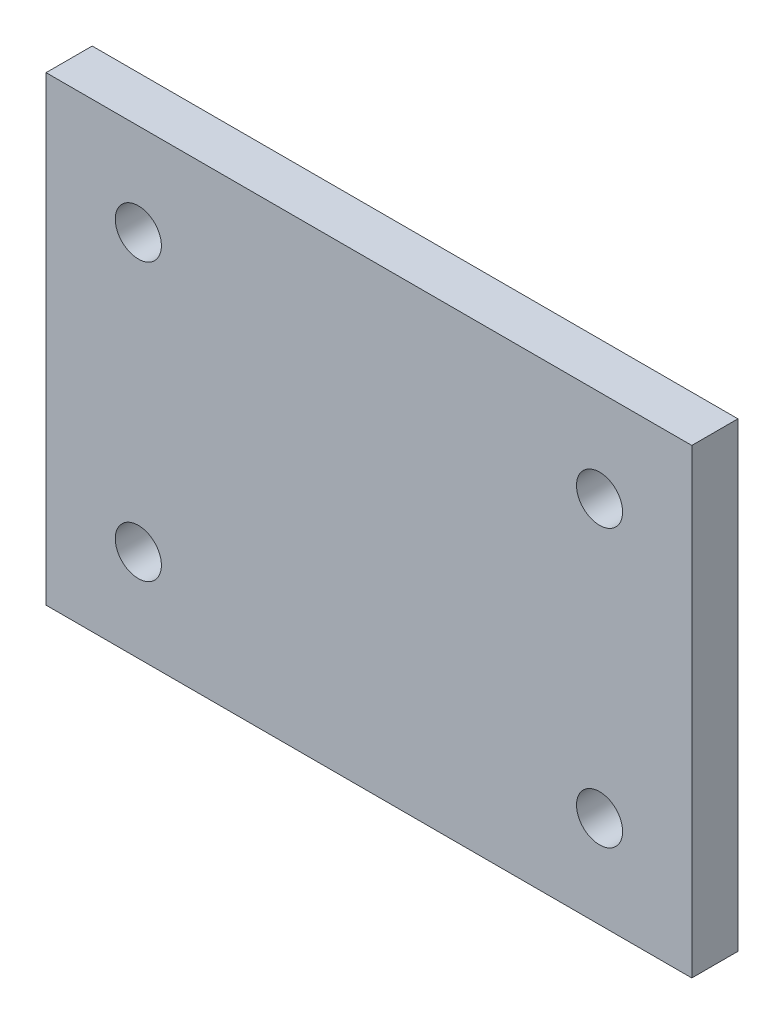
from build123d import *

# Parameters (mm, degrees)
ESQUISSE1_W             = 70
ESQUISSE1_H             = 50
BOSS_EXTRU_1_DEPTH      = 5
ESQUISSE2_R             = 2.5
ENL_V_MAT_EXTRU_1_DEPTH = 87.168439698


with BuildPart() as part:
    # Esquisse1 → Boss.-Extru.1 (new body)
    with BuildSketch(Plane.XY):
        with Locations((35, 25)):
            Rectangle(ESQUISSE1_W, ESQUISSE1_H)
    extrude(amount=BOSS_EXTRU_1_DEPTH)

    # Esquisse2 → Enl_v. mat.-Extru.1 (cut, through all)
    with BuildSketch(Plane.XY.offset(5)):
        with Locations((10, 40)):
            Circle(ESQUISSE2_R)
        with Locations((60, 40)):
            Circle(ESQUISSE2_R)
        with Locations((60, 10)):
            Circle(ESQUISSE2_R)
        with Locations((10, 10)):
            Circle(ESQUISSE2_R)
    extrude(amount=-ENL_V_MAT_EXTRU_1_DEPTH, mode=Mode.SUBTRACT)


solid = part.part
